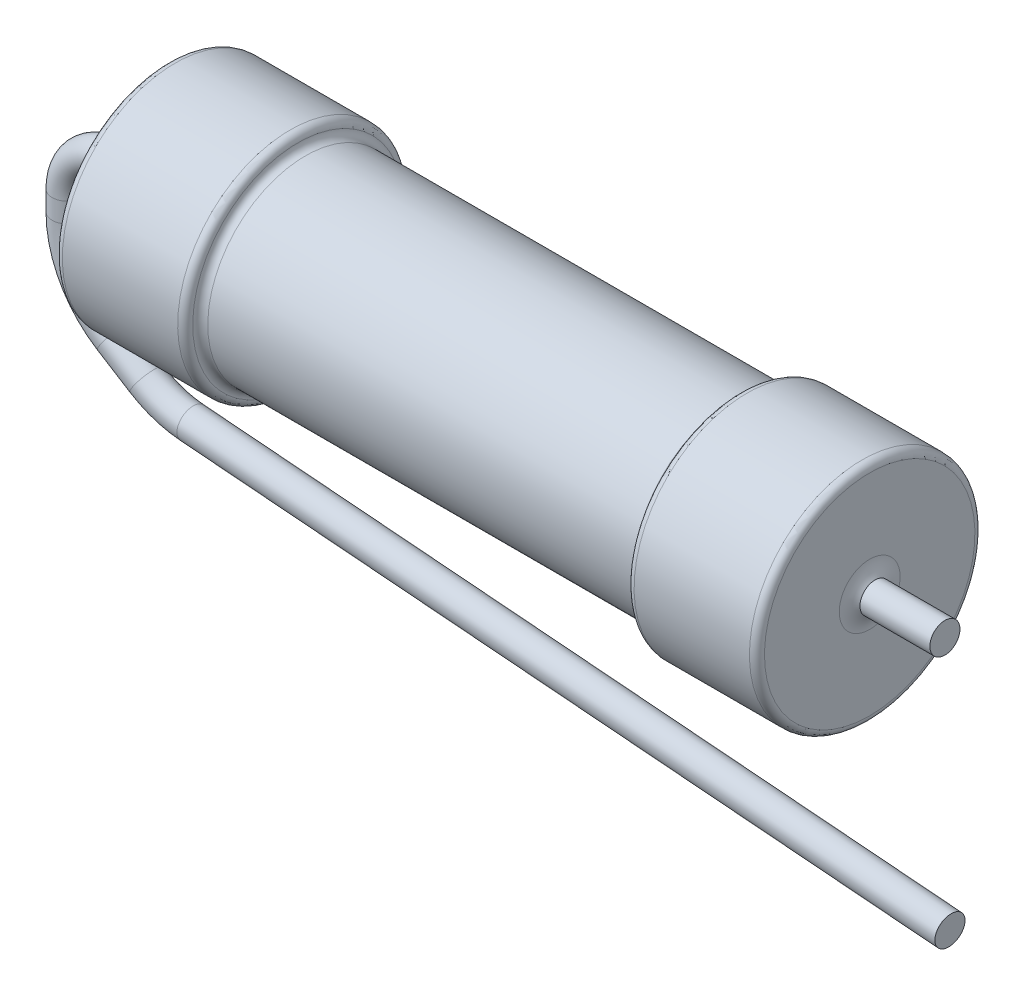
ISO-10303-21;
HEADER;
FILE_DESCRIPTION(('STEP AP214'),'2;1');
FILE_NAME('part.step','',(''),(''),'','','');
FILE_SCHEMA(('AUTOMOTIVE_DESIGN { 1 0 10303 214 1 1 1 1 }'));
ENDSEC;
DATA;
#1=APPLICATION_CONTEXT('core data for automotive mechanical design processes');
#2=APPLICATION_PROTOCOL_DEFINITION('international standard','automotive_design',2000,#1);
#3=PRODUCT_CONTEXT('',#1,'mechanical');
#4=PRODUCT('Part','Part','',(#3));
#5=PRODUCT_RELATED_PRODUCT_CATEGORY('part','',(#4));
#6=PRODUCT_DEFINITION_FORMATION('','',#4);
#7=PRODUCT_DEFINITION_CONTEXT('part definition',#1,'design');
#8=PRODUCT_DEFINITION('design','',#6,#7);
#9=PRODUCT_DEFINITION_SHAPE('','',#8);
#10=(LENGTH_UNIT() NAMED_UNIT(*) SI_UNIT(.MILLI.,.METRE.));
#11=(NAMED_UNIT(*) PLANE_ANGLE_UNIT() SI_UNIT($,.RADIAN.));
#12=(NAMED_UNIT(*) SI_UNIT($,.STERADIAN.) SOLID_ANGLE_UNIT());
#13=UNCERTAINTY_MEASURE_WITH_UNIT(LENGTH_MEASURE(1.E-05),#10,'distance_accuracy_value','');
#14=(GEOMETRIC_REPRESENTATION_CONTEXT(3) GLOBAL_UNCERTAINTY_ASSIGNED_CONTEXT((#13)) GLOBAL_UNIT_ASSIGNED_CONTEXT((#10,
#11,#12)) REPRESENTATION_CONTEXT('',''));
#15=CARTESIAN_POINT('',(0.,0.,0.));
#16=DIRECTION('',(0.,0.,1.));
#17=DIRECTION('',(1.,0.,0.));
#18=AXIS2_PLACEMENT_3D('',#15,#16,#17);
#19=CARTESIAN_POINT('',(-8.,-0.99837977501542,0.));
#20=DIRECTION('',(0.,0.,1.));
#21=DIRECTION('',(1.,0.,0.));
#22=AXIS2_PLACEMENT_3D('',#19,#20,#21);
#23=TOROIDAL_SURFACE('',#22,1.,0.3);
#24=CARTESIAN_POINT('',(-8.,0.00162022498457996,0.));
#25=DIRECTION('',(-1.,0.,0.));
#26=DIRECTION('',(0.,-1.,0.));
#27=AXIS2_PLACEMENT_3D('',#24,#25,#26);
#28=CIRCLE('',#27,0.3);
#29=CARTESIAN_POINT('',(-8.,0.30162022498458,0.));
#30=VERTEX_POINT('',#29);
#31=EDGE_CURVE('E10',#30,#30,#28,.T.);
#32=CARTESIAN_POINT('',(-9.,-0.998379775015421,0.));
#33=DIRECTION('',(0.,-1.,0.));
#34=DIRECTION('',(1.,0.,0.));
#35=AXIS2_PLACEMENT_3D('',#32,#33,#34);
#36=CIRCLE('',#35,0.3);
#37=CARTESIAN_POINT('',(-9.3,-0.998379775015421,0.));
#38=VERTEX_POINT('',#37);
#39=EDGE_CURVE('E31',#38,#38,#36,.T.);
#40=CARTESIAN_POINT('',(-8.,-0.99837977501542,0.));
#41=DIRECTION('',(0.,0.,1.));
#42=DIRECTION('',(1.,0.,0.));
#43=AXIS2_PLACEMENT_3D('',#40,#41,#42);
#44=CIRCLE('',#43,1.3);
#45=EDGE_CURVE('',#30,#38,#44,.T.);
#46=ORIENTED_EDGE('',*,*,#31,.T.);
#47=ORIENTED_EDGE('',*,*,#39,.F.);
#48=ORIENTED_EDGE('',*,*,#45,.T.);
#49=ORIENTED_EDGE('',*,*,#45,.F.);
#50=EDGE_LOOP('',(#46,#48,#47,#49));
#51=FACE_BOUND('',#50,.T.);
#52=ADVANCED_FACE('F15',(#51),#23,.T.);
#53=CARTESIAN_POINT('',(-7.,-1.39064559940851,0.));
#54=DIRECTION('',(0.,0.,1.));
#55=DIRECTION('',(1.,0.,0.));
#56=AXIS2_PLACEMENT_3D('',#53,#54,#55);
#57=TOROIDAL_SURFACE('',#56,2.,0.3);
#58=CARTESIAN_POINT('',(-9.,-1.39064559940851,0.));
#59=DIRECTION('',(0.,-1.,0.));
#60=DIRECTION('',(1.,0.,0.));
#61=AXIS2_PLACEMENT_3D('',#58,#59,#60);
#62=CIRCLE('',#61,0.3);
#63=CARTESIAN_POINT('',(-9.3,-1.39064559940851,0.));
#64=VERTEX_POINT('',#63);
#65=EDGE_CURVE('E23',#64,#64,#62,.T.);
#66=CARTESIAN_POINT('',(-8.06098534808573,-3.0860246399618,0.));
#67=DIRECTION('',(0.847689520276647,-0.530492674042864,0.));
#68=DIRECTION('',(0.530492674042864,0.847689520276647,0.));
#69=AXIS2_PLACEMENT_3D('',#66,#67,#68);
#70=CIRCLE('',#69,0.3);
#71=CARTESIAN_POINT('',(-8.22013315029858,-3.3403314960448,0.));
#72=VERTEX_POINT('',#71);
#73=EDGE_CURVE('E35',#72,#72,#70,.T.);
#74=CARTESIAN_POINT('',(-7.,-1.39064559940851,0.));
#75=DIRECTION('',(0.,0.,1.));
#76=DIRECTION('',(1.,0.,0.));
#77=AXIS2_PLACEMENT_3D('',#74,#75,#76);
#78=CIRCLE('',#77,2.3);
#79=EDGE_CURVE('',#64,#72,#78,.T.);
#80=ORIENTED_EDGE('',*,*,#65,.T.);
#81=ORIENTED_EDGE('',*,*,#73,.F.);
#82=ORIENTED_EDGE('',*,*,#79,.T.);
#83=ORIENTED_EDGE('',*,*,#79,.F.);
#84=EDGE_LOOP('',(#80,#82,#81,#83));
#85=FACE_BOUND('',#84,.T.);
#86=ADVANCED_FACE('F129',(#85),#57,.T.);
#87=CARTESIAN_POINT('',(-6.35320533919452,-1.79541623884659,0.));
#88=DIRECTION('',(0.,0.,1.));
#89=DIRECTION('',(1.,0.,0.));
#90=AXIS2_PLACEMENT_3D('',#87,#88,#89);
#91=TOROIDAL_SURFACE('',#90,2.,0.3);
#92=CARTESIAN_POINT('',(-7.41419068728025,-3.49079527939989,0.));
#93=DIRECTION('',(0.847689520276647,-0.530492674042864,0.));
#94=DIRECTION('',(0.530492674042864,0.847689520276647,0.));
#95=AXIS2_PLACEMENT_3D('',#92,#93,#94);
#96=CIRCLE('',#95,0.3);
#97=CARTESIAN_POINT('',(-7.57333848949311,-3.74510213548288,0.));
#98=VERTEX_POINT('',#97);
#99=EDGE_CURVE('E28',#98,#98,#96,.T.);
#100=CARTESIAN_POINT('',(-6.51294974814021,-3.78902646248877,0.));
#101=DIRECTION('',(0.996805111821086,-0.0798722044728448,0.));
#102=DIRECTION('',(0.0798722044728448,0.996805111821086,0.));
#103=AXIS2_PLACEMENT_3D('',#100,#101,#102);
#104=CIRCLE('',#103,0.3);
#105=CARTESIAN_POINT('',(-6.53691140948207,-4.08806799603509,0.));
#106=VERTEX_POINT('',#105);
#107=EDGE_CURVE('E39',#106,#106,#104,.T.);
#108=CARTESIAN_POINT('',(-6.35320533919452,-1.79541623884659,0.));
#109=DIRECTION('',(0.,0.,1.));
#110=DIRECTION('',(1.,0.,0.));
#111=AXIS2_PLACEMENT_3D('',#108,#109,#110);
#112=CIRCLE('',#111,2.3);
#113=EDGE_CURVE('',#98,#106,#112,.T.);
#114=ORIENTED_EDGE('',*,*,#99,.T.);
#115=ORIENTED_EDGE('',*,*,#107,.F.);
#116=ORIENTED_EDGE('',*,*,#113,.T.);
#117=ORIENTED_EDGE('',*,*,#113,.F.);
#118=EDGE_LOOP('',(#114,#116,#115,#117));
#119=FACE_BOUND('',#118,.T.);
#120=ADVANCED_FACE('F135',(#119),#91,.T.);
#121=CARTESIAN_POINT('',(8.5,0.00162022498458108,0.));
#122=DIRECTION('',(-1.,0.,0.));
#123=DIRECTION('',(0.,-1.,0.));
#124=AXIS2_PLACEMENT_3D('',#121,#122,#123);
#125=CYLINDRICAL_SURFACE('',#124,0.3);
#126=CARTESIAN_POINT('',(7.10543007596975,0.00162022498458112,0.));
#127=DIRECTION('',(1.,0.,0.));
#128=DIRECTION('',(0.,1.,0.));
#129=AXIS2_PLACEMENT_3D('',#126,#127,#128);
#130=CIRCLE('',#129,0.3);
#131=CARTESIAN_POINT('',(7.10543007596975,0.301620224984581,0.));
#132=VERTEX_POINT('',#131);
#133=EDGE_CURVE('E38',#132,#132,#130,.T.);
#134=ORIENTED_EDGE('',*,*,#133,.T.);
#135=EDGE_LOOP('',(#134));
#136=FACE_BOUND('',#135,.T.);
#137=CARTESIAN_POINT('',(8.5,0.00162022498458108,0.));
#138=DIRECTION('',(1.,0.,0.));
#139=DIRECTION('',(0.,1.,0.));
#140=AXIS2_PLACEMENT_3D('',#137,#138,#139);
#141=CIRCLE('',#140,0.3);
#142=CARTESIAN_POINT('',(8.5,0.301620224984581,0.));
#143=VERTEX_POINT('',#142);
#144=EDGE_CURVE('E45',#143,#143,#141,.T.);
#145=ORIENTED_EDGE('',*,*,#144,.F.);
#146=EDGE_LOOP('',(#145));
#147=FACE_BOUND('',#146,.T.);
#148=ADVANCED_FACE('F142',(#136,#147),#125,.T.);
#149=CARTESIAN_POINT('',(-9.,-0.998379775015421,0.));
#150=DIRECTION('',(0.,-1.,0.));
#151=DIRECTION('',(0.,0.,-1.));
#152=AXIS2_PLACEMENT_3D('',#149,#150,#151);
#153=CYLINDRICAL_SURFACE('',#152,0.3);
#154=ORIENTED_EDGE('',*,*,#65,.F.);
#155=EDGE_LOOP('',(#154));
#156=FACE_BOUND('',#155,.T.);
#157=ORIENTED_EDGE('',*,*,#39,.T.);
#158=EDGE_LOOP('',(#157));
#159=FACE_BOUND('',#158,.T.);
#160=ADVANCED_FACE('F146',(#156,#159),#153,.T.);
#161=CARTESIAN_POINT('',(-8.06098534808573,-3.0860246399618,0.));
#162=DIRECTION('',(0.847689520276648,-0.530492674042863,0.));
#163=DIRECTION('',(0.530492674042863,0.847689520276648,0.));
#164=AXIS2_PLACEMENT_3D('',#161,#162,#163);
#165=CYLINDRICAL_SURFACE('',#164,0.3);
#166=ORIENTED_EDGE('',*,*,#99,.F.);
#167=EDGE_LOOP('',(#166));
#168=FACE_BOUND('',#167,.T.);
#169=ORIENTED_EDGE('',*,*,#73,.T.);
#170=EDGE_LOOP('',(#169));
#171=FACE_BOUND('',#170,.T.);
#172=ADVANCED_FACE('F150',(#168,#171),#165,.T.);
#173=CARTESIAN_POINT('',(-6.51294974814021,-3.78902646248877,0.));
#174=DIRECTION('',(0.996805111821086,-0.0798722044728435,0.));
#175=DIRECTION('',(0.0798722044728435,0.996805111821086,0.));
#176=AXIS2_PLACEMENT_3D('',#173,#174,#175);
#177=CYLINDRICAL_SURFACE('',#176,0.3);
#178=CARTESIAN_POINT('',(8.6,-5.,0.));
#179=DIRECTION('',(0.996805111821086,-0.0798722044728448,0.));
#180=DIRECTION('',(0.0798722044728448,0.996805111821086,0.));
#181=AXIS2_PLACEMENT_3D('',#178,#179,#180);
#182=CIRCLE('',#181,0.3);
#183=CARTESIAN_POINT('',(8.62396166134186,-4.70095846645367,0.));
#184=VERTEX_POINT('',#183);
#185=EDGE_CURVE('E33',#184,#184,#182,.T.);
#186=ORIENTED_EDGE('',*,*,#185,.F.);
#187=EDGE_LOOP('',(#186));
#188=FACE_BOUND('',#187,.T.);
#189=ORIENTED_EDGE('',*,*,#107,.T.);
#190=EDGE_LOOP('',(#189));
#191=FACE_BOUND('',#190,.T.);
#192=ADVANCED_FACE('F154',(#188,#191),#177,.T.);
#193=CARTESIAN_POINT('',(-8.,0.00162022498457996,0.));
#194=DIRECTION('',(1.,0.,0.));
#195=DIRECTION('',(0.,1.,0.));
#196=AXIS2_PLACEMENT_3D('',#193,#194,#195);
#197=CYLINDRICAL_SURFACE('',#196,0.3);
#198=CARTESIAN_POINT('',(-7.10543007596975,0.00162022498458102,0.));
#199=DIRECTION('',(-1.,0.,0.));
#200=DIRECTION('',(0.,-1.,0.));
#201=AXIS2_PLACEMENT_3D('',#198,#199,#200);
#202=CIRCLE('',#201,0.3);
#203=CARTESIAN_POINT('',(-7.10543007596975,-0.298379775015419,0.));
#204=VERTEX_POINT('',#203);
#205=EDGE_CURVE('E44',#204,#204,#202,.T.);
#206=ORIENTED_EDGE('',*,*,#205,.T.);
#207=EDGE_LOOP('',(#206));
#208=FACE_BOUND('',#207,.T.);
#209=ORIENTED_EDGE('',*,*,#31,.F.);
#210=EDGE_LOOP('',(#209));
#211=FACE_BOUND('',#210,.T.);
#212=ADVANCED_FACE('F158',(#208,#211),#197,.T.);
#213=CARTESIAN_POINT('',(6.85,0.0016202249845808,0.));
#214=DIRECTION('',(-1.,0.,0.));
#215=DIRECTION('',(0.,-1.,0.));
#216=AXIS2_PLACEMENT_3D('',#213,#214,#215);
#217=TOROIDAL_SURFACE('',#216,2.09837977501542,0.15);
#218=CARTESIAN_POINT('',(6.85,0.00162022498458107,0.));
#219=DIRECTION('',(-1.,0.,0.));
#220=DIRECTION('',(0.,-1.,0.));
#221=AXIS2_PLACEMENT_3D('',#218,#219,#220);
#222=CIRCLE('',#221,2.24837977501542);
#223=CARTESIAN_POINT('',(6.85,-2.24675955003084,0.));
#224=VERTEX_POINT('',#223);
#225=EDGE_CURVE('E58',#224,#224,#222,.T.);
#226=ORIENTED_EDGE('',*,*,#225,.F.);
#227=EDGE_LOOP('',(#226));
#228=FACE_BOUND('',#227,.T.);
#229=CARTESIAN_POINT('',(7.,0.00162022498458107,0.));
#230=DIRECTION('',(-1.,0.,0.));
#231=DIRECTION('',(0.,-1.,0.));
#232=AXIS2_PLACEMENT_3D('',#229,#230,#231);
#233=CIRCLE('',#232,2.09837977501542);
#234=CARTESIAN_POINT('',(7.,-2.09675955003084,0.));
#235=VERTEX_POINT('',#234);
#236=EDGE_CURVE('E54',#235,#235,#233,.T.);
#237=ORIENTED_EDGE('',*,*,#236,.T.);
#238=EDGE_LOOP('',(#237));
#239=FACE_BOUND('',#238,.T.);
#240=ADVANCED_FACE('F162',(#228,#239),#217,.T.);
#241=CARTESIAN_POINT('',(-7.4,0.00162022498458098,0.));
#242=DIRECTION('',(-1.,0.,0.));
#243=DIRECTION('',(0.,-1.,0.));
#244=AXIS2_PLACEMENT_3D('',#241,#242,#243);
#245=CYLINDRICAL_SURFACE('',#244,2.24837977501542);
#246=CARTESIAN_POINT('',(4.55,0.00162022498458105,0.));
#247=DIRECTION('',(-1.,0.,0.));
#248=DIRECTION('',(0.,-1.,0.));
#249=AXIS2_PLACEMENT_3D('',#246,#247,#248);
#250=CIRCLE('',#249,2.24837977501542);
#251=CARTESIAN_POINT('',(4.55,-2.24675955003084,0.));
#252=VERTEX_POINT('',#251);
#253=EDGE_CURVE('E57',#252,#252,#250,.T.);
#254=ORIENTED_EDGE('',*,*,#253,.F.);
#255=EDGE_LOOP('',(#254));
#256=FACE_BOUND('',#255,.T.);
#257=ORIENTED_EDGE('',*,*,#225,.T.);
#258=EDGE_LOOP('',(#257));
#259=FACE_BOUND('',#258,.T.);
#260=ADVANCED_FACE('F166',(#256,#259),#245,.T.);
#261=CARTESIAN_POINT('',(4.55,0.0016202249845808,0.));
#262=DIRECTION('',(-1.,0.,0.));
#263=DIRECTION('',(0.,-1.,0.));
#264=AXIS2_PLACEMENT_3D('',#261,#262,#263);
#265=TOROIDAL_SURFACE('',#264,2.09837977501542,0.15);
#266=CARTESIAN_POINT('',(4.4,0.00162022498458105,0.));
#267=DIRECTION('',(-1.,0.,0.));
#268=DIRECTION('',(0.,-1.,0.));
#269=AXIS2_PLACEMENT_3D('',#266,#267,#268);
#270=CIRCLE('',#269,2.09837977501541);
#271=CARTESIAN_POINT('',(4.4,-2.09675955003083,0.));
#272=VERTEX_POINT('',#271);
#273=EDGE_CURVE('E66',#272,#272,#270,.T.);
#274=ORIENTED_EDGE('',*,*,#273,.F.);
#275=EDGE_LOOP('',(#274));
#276=FACE_BOUND('',#275,.T.);
#277=ORIENTED_EDGE('',*,*,#253,.T.);
#278=EDGE_LOOP('',(#277));
#279=FACE_BOUND('',#278,.T.);
#280=ADVANCED_FACE('F170',(#276,#279),#265,.T.);
#281=CARTESIAN_POINT('',(4.25,0.0016202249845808,0.));
#282=DIRECTION('',(-1.,0.,0.));
#283=DIRECTION('',(0.,-1.,0.));
#284=AXIS2_PLACEMENT_3D('',#281,#282,#283);
#285=TOROIDAL_SURFACE('',#284,2.09837977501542,0.15);
#286=ORIENTED_EDGE('',*,*,#273,.T.);
#287=EDGE_LOOP('',(#286));
#288=FACE_BOUND('',#287,.T.);
#289=CARTESIAN_POINT('',(4.25,0.00162022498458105,0.));
#290=DIRECTION('',(-1.,0.,0.));
#291=DIRECTION('',(0.,-1.,0.));
#292=AXIS2_PLACEMENT_3D('',#289,#290,#291);
#293=CIRCLE('',#292,1.94837977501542);
#294=CARTESIAN_POINT('',(4.25,-1.94675955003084,0.));
#295=VERTEX_POINT('',#294);
#296=EDGE_CURVE('E69',#295,#295,#293,.T.);
#297=ORIENTED_EDGE('',*,*,#296,.F.);
#298=EDGE_LOOP('',(#297));
#299=FACE_BOUND('',#298,.T.);
#300=ADVANCED_FACE('F125',(#288,#299),#285,.F.);
#301=CARTESIAN_POINT('',(-7.4,0.00162022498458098,0.));
#302=DIRECTION('',(-1.,0.,0.));
#303=DIRECTION('',(0.,-1.,0.));
#304=AXIS2_PLACEMENT_3D('',#301,#302,#303);
#305=CYLINDRICAL_SURFACE('',#304,1.94837977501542);
#306=CARTESIAN_POINT('',(-4.25,0.001620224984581,0.));
#307=DIRECTION('',(-1.,0.,0.));
#308=DIRECTION('',(0.,-1.,0.));
#309=AXIS2_PLACEMENT_3D('',#306,#307,#308);
#310=CIRCLE('',#309,1.94837977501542);
#311=CARTESIAN_POINT('',(-4.25,-1.94675955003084,0.));
#312=VERTEX_POINT('',#311);
#313=EDGE_CURVE('E65',#312,#312,#310,.T.);
#314=ORIENTED_EDGE('',*,*,#313,.F.);
#315=EDGE_LOOP('',(#314));
#316=FACE_BOUND('',#315,.T.);
#317=ORIENTED_EDGE('',*,*,#296,.T.);
#318=EDGE_LOOP('',(#317));
#319=FACE_BOUND('',#318,.T.);
#320=ADVANCED_FACE('F118',(#316,#319),#305,.T.);
#321=CARTESIAN_POINT('',(-4.25,0.0016202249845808,0.));
#322=DIRECTION('',(-1.,0.,0.));
#323=DIRECTION('',(0.,-1.,0.));
#324=AXIS2_PLACEMENT_3D('',#321,#322,#323);
#325=TOROIDAL_SURFACE('',#324,2.09837977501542,0.15);
#326=ORIENTED_EDGE('',*,*,#313,.T.);
#327=EDGE_LOOP('',(#326));
#328=FACE_BOUND('',#327,.T.);
#329=CARTESIAN_POINT('',(-4.4,0.00162022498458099,0.));
#330=DIRECTION('',(-1.,0.,0.));
#331=DIRECTION('',(0.,-1.,0.));
#332=AXIS2_PLACEMENT_3D('',#329,#330,#331);
#333=CIRCLE('',#332,2.09837977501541);
#334=CARTESIAN_POINT('',(-4.4,-2.09675955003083,0.));
#335=VERTEX_POINT('',#334);
#336=EDGE_CURVE('E72',#335,#335,#333,.T.);
#337=ORIENTED_EDGE('',*,*,#336,.F.);
#338=EDGE_LOOP('',(#337));
#339=FACE_BOUND('',#338,.T.);
#340=ADVANCED_FACE('F113',(#328,#339),#325,.F.);
#341=CARTESIAN_POINT('',(-4.55,0.0016202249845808,0.));
#342=DIRECTION('',(-1.,0.,0.));
#343=DIRECTION('',(0.,-1.,0.));
#344=AXIS2_PLACEMENT_3D('',#341,#342,#343);
#345=TOROIDAL_SURFACE('',#344,2.09837977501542,0.15);
#346=CARTESIAN_POINT('',(-4.55,0.00162022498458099,0.));
#347=DIRECTION('',(-1.,0.,0.));
#348=DIRECTION('',(0.,-1.,0.));
#349=AXIS2_PLACEMENT_3D('',#346,#347,#348);
#350=CIRCLE('',#349,2.24837977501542);
#351=CARTESIAN_POINT('',(-4.55,-2.24675955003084,0.));
#352=VERTEX_POINT('',#351);
#353=EDGE_CURVE('E61',#352,#352,#350,.T.);
#354=ORIENTED_EDGE('',*,*,#353,.F.);
#355=EDGE_LOOP('',(#354));
#356=FACE_BOUND('',#355,.T.);
#357=ORIENTED_EDGE('',*,*,#336,.T.);
#358=EDGE_LOOP('',(#357));
#359=FACE_BOUND('',#358,.T.);
#360=ADVANCED_FACE('F107',(#356,#359),#345,.T.);
#361=CARTESIAN_POINT('',(-7.4,0.00162022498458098,0.));
#362=DIRECTION('',(-1.,0.,0.));
#363=DIRECTION('',(0.,-1.,0.));
#364=AXIS2_PLACEMENT_3D('',#361,#362,#363);
#365=CYLINDRICAL_SURFACE('',#364,2.24837977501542);
#366=CARTESIAN_POINT('',(-6.85,0.00162022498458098,0.));
#367=DIRECTION('',(-1.,0.,0.));
#368=DIRECTION('',(0.,-1.,0.));
#369=AXIS2_PLACEMENT_3D('',#366,#367,#368);
#370=CIRCLE('',#369,2.24837977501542);
#371=CARTESIAN_POINT('',(-6.85,-2.24675955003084,0.));
#372=VERTEX_POINT('',#371);
#373=EDGE_CURVE('E77',#372,#372,#370,.T.);
#374=ORIENTED_EDGE('',*,*,#373,.F.);
#375=EDGE_LOOP('',(#374));
#376=FACE_BOUND('',#375,.T.);
#377=ORIENTED_EDGE('',*,*,#353,.T.);
#378=EDGE_LOOP('',(#377));
#379=FACE_BOUND('',#378,.T.);
#380=ADVANCED_FACE('F101',(#376,#379),#365,.T.);
#381=CARTESIAN_POINT('',(-6.85,0.0016202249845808,0.));
#382=DIRECTION('',(-1.,0.,0.));
#383=DIRECTION('',(0.,-1.,0.));
#384=AXIS2_PLACEMENT_3D('',#381,#382,#383);
#385=TOROIDAL_SURFACE('',#384,2.09837977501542,0.15);
#386=CARTESIAN_POINT('',(-7.,0.00162022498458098,0.));
#387=DIRECTION('',(-1.,0.,0.));
#388=DIRECTION('',(0.,-1.,0.));
#389=AXIS2_PLACEMENT_3D('',#386,#387,#388);
#390=CIRCLE('',#389,2.09837977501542);
#391=CARTESIAN_POINT('',(-7.,-2.09675955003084,0.));
#392=VERTEX_POINT('',#391);
#393=EDGE_CURVE('E62',#392,#392,#390,.T.);
#394=ORIENTED_EDGE('',*,*,#393,.F.);
#395=EDGE_LOOP('',(#394));
#396=FACE_BOUND('',#395,.T.);
#397=ORIENTED_EDGE('',*,*,#373,.T.);
#398=EDGE_LOOP('',(#397));
#399=FACE_BOUND('',#398,.T.);
#400=ADVANCED_FACE('F98',(#396,#399),#385,.T.);
#401=CARTESIAN_POINT('',(-7.5,0.00162022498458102,0.));
#402=DIRECTION('',(-1.,0.,0.));
#403=DIRECTION('',(0.,-1.,0.));
#404=AXIS2_PLACEMENT_3D('',#401,#402,#403);
#405=TOROIDAL_SURFACE('',#404,0.607106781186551,0.5);
#406=CARTESIAN_POINT('',(-7.,0.00162022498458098,0.));
#407=DIRECTION('',(-1.,0.,0.));
#408=DIRECTION('',(0.,-1.,0.));
#409=AXIS2_PLACEMENT_3D('',#406,#407,#408);
#410=CIRCLE('',#409,0.607106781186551);
#411=CARTESIAN_POINT('',(-7.,-0.60548655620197,0.));
#412=VERTEX_POINT('',#411);
#413=EDGE_CURVE('E80',#412,#412,#410,.T.);
#414=ORIENTED_EDGE('',*,*,#413,.T.);
#415=EDGE_LOOP('',(#414));
#416=FACE_BOUND('',#415,.T.);
#417=ORIENTED_EDGE('',*,*,#205,.F.);
#418=EDGE_LOOP('',(#417));
#419=FACE_BOUND('',#418,.T.);
#420=ADVANCED_FACE('F87',(#416,#419),#405,.F.);
#421=CARTESIAN_POINT('',(7.5,0.00162022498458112,0.));
#422=DIRECTION('',(-1.,0.,0.));
#423=DIRECTION('',(0.,-1.,0.));
#424=AXIS2_PLACEMENT_3D('',#421,#422,#423);
#425=TOROIDAL_SURFACE('',#424,0.607106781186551,0.500000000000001);
#426=ORIENTED_EDGE('',*,*,#133,.F.);
#427=EDGE_LOOP('',(#426));
#428=FACE_BOUND('',#427,.T.);
#429=CARTESIAN_POINT('',(7.,0.00162022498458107,0.));
#430=DIRECTION('',(-1.,0.,0.));
#431=DIRECTION('',(0.,-1.,0.));
#432=AXIS2_PLACEMENT_3D('',#429,#430,#431);
#433=CIRCLE('',#432,0.607106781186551);
#434=CARTESIAN_POINT('',(7.,-0.60548655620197,0.));
#435=VERTEX_POINT('',#434);
#436=EDGE_CURVE('E19',#435,#435,#433,.T.);
#437=ORIENTED_EDGE('',*,*,#436,.F.);
#438=EDGE_LOOP('',(#437));
#439=FACE_BOUND('',#438,.T.);
#440=ADVANCED_FACE('F94',(#428,#439),#425,.F.);
#441=CARTESIAN_POINT('',(-7.,0.608727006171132,0.));
#442=DIRECTION('',(1.,0.,0.));
#443=DIRECTION('',(0.,1.,0.));
#444=AXIS2_PLACEMENT_3D('',#441,#442,#443);
#445=PLANE('',#444);
#446=ORIENTED_EDGE('',*,*,#413,.F.);
#447=EDGE_LOOP('',(#446));
#448=FACE_BOUND('',#447,.T.);
#449=ORIENTED_EDGE('',*,*,#393,.T.);
#450=EDGE_LOOP('',(#449));
#451=FACE_BOUND('',#450,.T.);
#452=ADVANCED_FACE('F90',(#448,#451),#445,.F.);
#453=CARTESIAN_POINT('',(7.,0.608727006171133,0.));
#454=DIRECTION('',(-1.,0.,0.));
#455=DIRECTION('',(0.,-1.,0.));
#456=AXIS2_PLACEMENT_3D('',#453,#454,#455);
#457=PLANE('',#456);
#458=ORIENTED_EDGE('',*,*,#236,.F.);
#459=EDGE_LOOP('',(#458));
#460=FACE_BOUND('',#459,.T.);
#461=ORIENTED_EDGE('',*,*,#436,.T.);
#462=EDGE_LOOP('',(#461));
#463=FACE_BOUND('',#462,.T.);
#464=ADVANCED_FACE('F93',(#460,#463),#457,.F.);
#465=CARTESIAN_POINT('',(8.6,-5.,0.));
#466=DIRECTION('',(0.996805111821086,-0.0798722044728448,0.));
#467=DIRECTION('',(0.0798722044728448,0.996805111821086,0.));
#468=AXIS2_PLACEMENT_3D('',#465,#466,#467);
#469=PLANE('',#468);
#470=ORIENTED_EDGE('',*,*,#185,.T.);
#471=EDGE_LOOP('',(#470));
#472=FACE_BOUND('',#471,.T.);
#473=ADVANCED_FACE('F192',(#472),#469,.T.);
#474=CARTESIAN_POINT('',(8.5,0.00162022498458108,0.));
#475=DIRECTION('',(1.,0.,0.));
#476=DIRECTION('',(0.,1.,0.));
#477=AXIS2_PLACEMENT_3D('',#474,#475,#476);
#478=PLANE('',#477);
#479=ORIENTED_EDGE('',*,*,#144,.T.);
#480=EDGE_LOOP('',(#479));
#481=FACE_BOUND('',#480,.T.);
#482=ADVANCED_FACE('F17',(#481),#478,.T.);
#483=CLOSED_SHELL('',(#52,#86,#120,#148,#160,#172,#192,#212,#240,#260,#280,#300,#320,#340,#360,
#380,#400,#420,#440,#452,#464,#473,#482));
#484=MANIFOLD_SOLID_BREP('B1',#483);
#485=ADVANCED_BREP_SHAPE_REPRESENTATION('',(#18,#484),#14);
#486=SHAPE_DEFINITION_REPRESENTATION(#9,#485);
ENDSEC;
END-ISO-10303-21;
